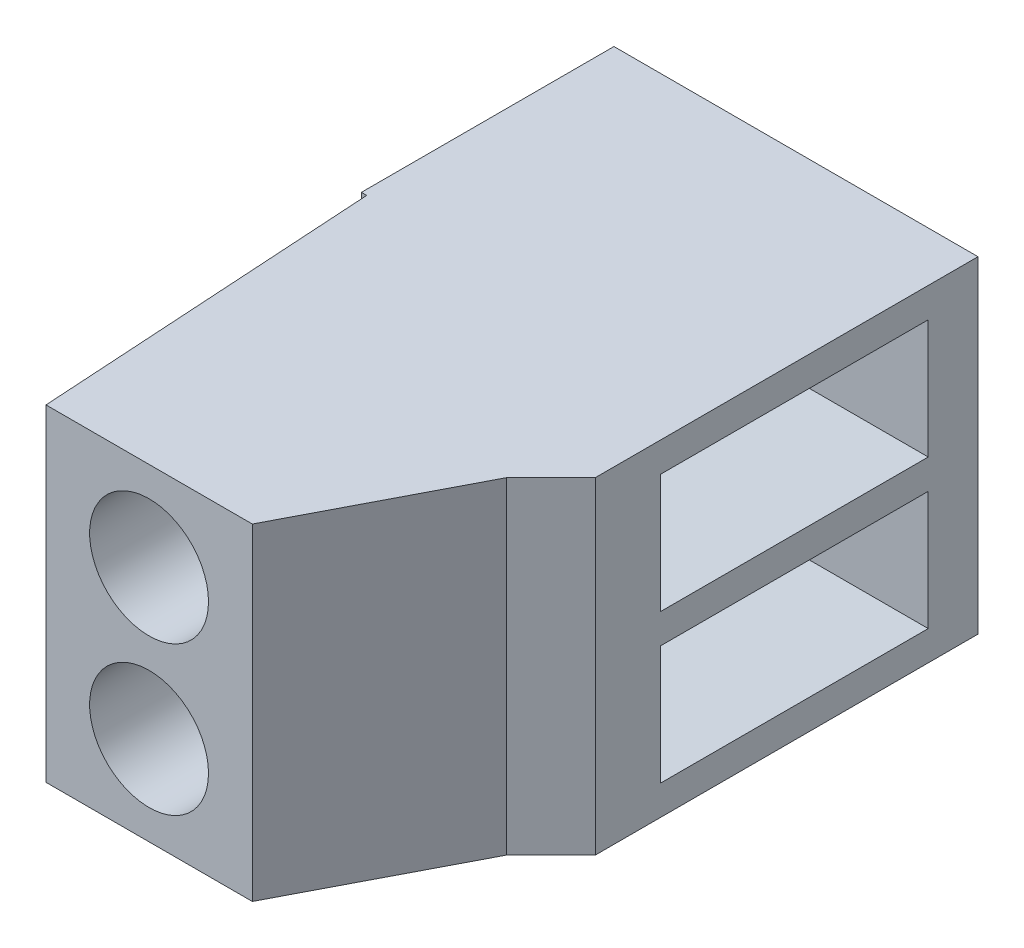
from build123d import *

# Parameters (mm, degrees)
SKETCH28_W                   = 2.54
SKETCH28_H                   = 5.588
EXTRUDE1_DEPTH               = 4.445
EXTRUDE2_DEPTH               = 5.588
SKETCH32_R                   = 1.016
CUT_EXTRUDE7_DEPTH           = 2.54
SKETCH37_W                   = 2.54
SKETCH37_H                   = 5.588
CUT_EXTRUDE10_DEPTH          = 9.899066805
SKETCH36_W                   = 2.032
SKETCH36_H                   = 4.575650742
CUT_EXTRUDE9_DEPTH           = 2.00025
CUT_EXTRUDE9_DRAFT           = 10
CUT_EXTRUDE9_PROFILE_2_DEPTH = 2.00025
CUT_EXTRUDE9_PROFILE_2_DRAFT = 10


with BuildPart() as part:
    # Sketch28 → Extrude1 (new body)
    with BuildSketch(Plane(origin=(-163.386210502, 51.570621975, 0), x_dir=(1, 0, 0), z_dir=(0, 0, 1))):
        with Locations((164.656210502, -51.570621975)):
            Rectangle(SKETCH28_W, SKETCH28_H)
    extrude(amount=EXTRUDE1_DEPTH)

    # Sketch30 → Extrude2 (add)
    with BuildSketch(Plane(origin=(96.95583934, 2.794, -5.964630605), x_dir=(-1, 0, 0), z_dir=(0, 1, 0))):
        Polygon((96.95583934, 5.964630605), (103.17883934, 5.964630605), (103.17883934, 10.282630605), (103.087982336, 10.282630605), (102.727798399, 16.124630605), (99.200778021, 16.124630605), (97.715698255, 13.267130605), (96.95583934, 12.50727169), align=None)
    extrude(amount=-EXTRUDE2_DEPTH)

    # Sketch32 → Cut-Extrude7 (cut)
    with BuildSketch(Plane(origin=(-195.592010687, 50.343322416, 10.16), x_dir=(1, 0, 0), z_dir=(0, 0, 1))):
        with Locations((191.581772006, -49.073322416)):
            Circle(SKETCH32_R)
        with Locations((191.581772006, -51.613322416)):
            Circle(SKETCH32_R)
    extrude(amount=-CUT_EXTRUDE7_DEPTH, mode=Mode.SUBTRACT)

    # Sketch37 → Cut-Extrude10 (cut, through all)
    with BuildSketch(Plane.XY.offset(4.445)):
        with Locations((1.27, 0)):
            Rectangle(SKETCH37_W, SKETCH37_H)
    extrude(amount=-CUT_EXTRUDE10_DEPTH, mode=Mode.SUBTRACT)


with BuildPart() as cut_extrude9_tool:
    # Sketch36 → Cut-Extrude9 (with draft: the straight prism first)
    with BuildSketch(Plane(origin=(0, 49.512466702, 10.327073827), x_dir=(0, 1, 0), z_dir=(-1, 0, 0))):
        with Locations((-50.782466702, 7.188348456)):
            Rectangle(SKETCH36_W, SKETCH36_H)
    extrude(amount=CUT_EXTRUDE9_DEPTH)
    # Cut-Extrude9: the draft: its side faces are tilted about the plane it starts from
    cut_extrude9_sides = [cut_extrude9_tool.faces().sort_by_distance(p)[0] for p in [
        (-1.000125, -1.27, 5.426550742),
        (-1.000125, -0.254, 3.138725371),
        (-1.000125, -1.27, 0.8509),
        (-1.000125, -2.286, 3.138725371),
    ]]
    draft(cut_extrude9_sides, Plane(origin=(0, 49.512466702, 10.327073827), x_dir=(0, 1, 0), z_dir=(-1, 0, 0)), CUT_EXTRUDE9_DRAFT)


with BuildPart() as part_1:
    add(part.part)

    # Cut-Extrude9: cut by cut_extrude9_tool
    add(cut_extrude9_tool.part, mode=Mode.SUBTRACT)


with BuildPart() as cut_extrude9_profile_2_tool:
    # Sketch36 → Cut-Extrude9 profile 2 (with draft: the straight prism first)
    with BuildSketch(Plane(origin=(0, 49.512466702, 10.327073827), x_dir=(0, 1, 0), z_dir=(-1, 0, 0))):
        with Locations((-48.242466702, 7.188348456)):
            Rectangle(SKETCH36_W, SKETCH36_H)
    extrude(amount=CUT_EXTRUDE9_PROFILE_2_DEPTH)
    # Cut-Extrude9 profile 2: the draft: its side faces are tilted about the plane it starts from
    cut_extrude9_profile_2_sides = [cut_extrude9_profile_2_tool.faces().sort_by_distance(p)[0] for p in [
        (-1.000125, 1.27, 5.426550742),
        (-1.000125, 2.286, 3.138725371),
        (-1.000125, 1.27, 0.8509),
        (-1.000125, 0.254, 3.138725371),
    ]]
    draft(cut_extrude9_profile_2_sides, Plane(origin=(0, 49.512466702, 10.327073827), x_dir=(0, 1, 0), z_dir=(-1, 0, 0)), CUT_EXTRUDE9_PROFILE_2_DRAFT)


with BuildPart() as part_2:
    add(part_1.part)

    # Cut-Extrude9 profile 2: cut by cut_extrude9_profile_2_tool
    add(cut_extrude9_profile_2_tool.part, mode=Mode.SUBTRACT)


solid = part_2.part
